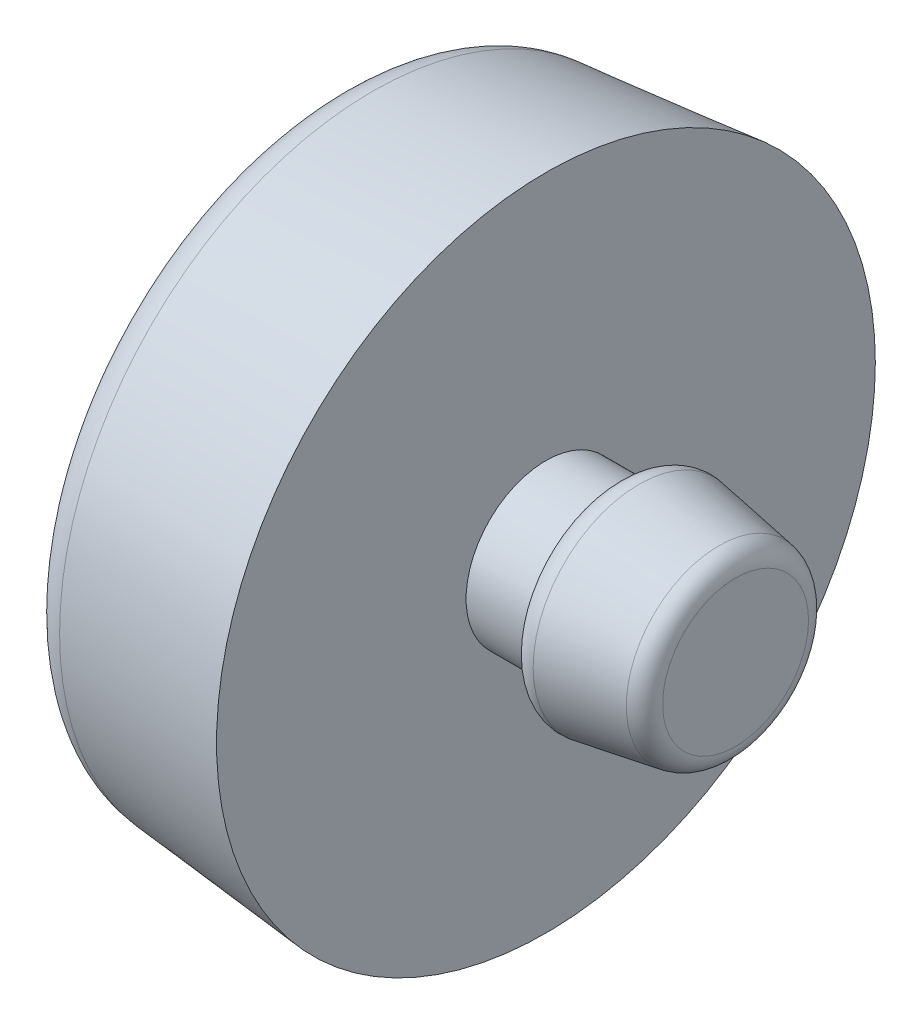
ISO-10303-21;
HEADER;
FILE_DESCRIPTION(('STEP AP214'),'2;1');
FILE_NAME('part.step','',(''),(''),'','','');
FILE_SCHEMA(('AUTOMOTIVE_DESIGN { 1 0 10303 214 1 1 1 1 }'));
ENDSEC;
DATA;
#1=APPLICATION_CONTEXT('core data for automotive mechanical design processes');
#2=APPLICATION_PROTOCOL_DEFINITION('international standard','automotive_design',2000,#1);
#3=PRODUCT_CONTEXT('',#1,'mechanical');
#4=PRODUCT('Part','Part','',(#3));
#5=PRODUCT_RELATED_PRODUCT_CATEGORY('part','',(#4));
#6=PRODUCT_DEFINITION_FORMATION('','',#4);
#7=PRODUCT_DEFINITION_CONTEXT('part definition',#1,'design');
#8=PRODUCT_DEFINITION('design','',#6,#7);
#9=PRODUCT_DEFINITION_SHAPE('','',#8);
#10=(LENGTH_UNIT() NAMED_UNIT(*) SI_UNIT(.MILLI.,.METRE.));
#11=(NAMED_UNIT(*) PLANE_ANGLE_UNIT() SI_UNIT($,.RADIAN.));
#12=(NAMED_UNIT(*) SI_UNIT($,.STERADIAN.) SOLID_ANGLE_UNIT());
#13=UNCERTAINTY_MEASURE_WITH_UNIT(LENGTH_MEASURE(1.E-05),#10,'distance_accuracy_value','');
#14=(GEOMETRIC_REPRESENTATION_CONTEXT(3) GLOBAL_UNCERTAINTY_ASSIGNED_CONTEXT((#13)) GLOBAL_UNIT_ASSIGNED_CONTEXT((#10,
#11,#12)) REPRESENTATION_CONTEXT('',''));
#15=CARTESIAN_POINT('',(0.,0.,0.));
#16=DIRECTION('',(0.,0.,1.));
#17=DIRECTION('',(1.,0.,0.));
#18=AXIS2_PLACEMENT_3D('',#15,#16,#17);
#19=CARTESIAN_POINT('',(-11.,0.,0.));
#20=DIRECTION('',(-1.,0.,0.));
#21=DIRECTION('',(0.,0.,1.));
#22=AXIS2_PLACEMENT_3D('',#19,#20,#21);
#23=PLANE('',#22);
#24=CARTESIAN_POINT('',(-11.,0.,0.));
#25=DIRECTION('',(-1.,0.,0.));
#26=DIRECTION('',(0.,0.,1.));
#27=AXIS2_PLACEMENT_3D('',#24,#25,#26);
#28=CIRCLE('',#27,13.681426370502);
#29=CARTESIAN_POINT('',(-11.,0.,13.681426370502));
#30=VERTEX_POINT('',#29);
#31=EDGE_CURVE('E10',#30,#30,#28,.T.);
#32=ORIENTED_EDGE('',*,*,#31,.T.);
#33=EDGE_LOOP('',(#32));
#34=FACE_BOUND('',#33,.T.);
#35=ADVANCED_FACE('F28',(#34),#23,.T.);
#36=CARTESIAN_POINT('',(-0.5,0.,0.));
#37=DIRECTION('',(1.,0.,0.));
#38=DIRECTION('',(0.,0.,-1.));
#39=AXIS2_PLACEMENT_3D('',#36,#37,#38);
#40=CONICAL_SURFACE('',#39,16.5,0.0949517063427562);
#41=CARTESIAN_POINT('',(-9.18961818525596,0.,0.));
#42=DIRECTION('',(-1.,0.,0.));
#43=DIRECTION('',(0.,0.,1.));
#44=AXIS2_PLACEMENT_3D('',#41,#42,#43);
#45=CIRCLE('',#44,15.6724173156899);
#46=CARTESIAN_POINT('',(-9.18961818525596,0.,15.6724173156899));
#47=VERTEX_POINT('',#46);
#48=EDGE_CURVE('E34',#47,#47,#45,.F.);
#49=ORIENTED_EDGE('',*,*,#48,.T.);
#50=EDGE_LOOP('',(#49));
#51=FACE_BOUND('',#50,.T.);
#52=CARTESIAN_POINT('',(-0.5,0.,0.));
#53=DIRECTION('',(1.,0.,0.));
#54=DIRECTION('',(0.,0.,-1.));
#55=AXIS2_PLACEMENT_3D('',#52,#53,#54);
#56=CIRCLE('',#55,16.5);
#57=CARTESIAN_POINT('',(-0.5,0.,-16.5));
#58=VERTEX_POINT('',#57);
#59=EDGE_CURVE('E53',#58,#58,#56,.T.);
#60=ORIENTED_EDGE('',*,*,#59,.F.);
#61=EDGE_LOOP('',(#60));
#62=FACE_BOUND('',#61,.T.);
#63=ADVANCED_FACE('F77',(#51,#62),#40,.T.);
#64=CARTESIAN_POINT('',(-0.499999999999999,16.5,0.));
#65=DIRECTION('',(1.,0.,0.));
#66=DIRECTION('',(0.,0.,-1.));
#67=AXIS2_PLACEMENT_3D('',#64,#65,#66);
#68=PLANE('',#67);
#69=ORIENTED_EDGE('',*,*,#59,.T.);
#70=EDGE_LOOP('',(#69));
#71=FACE_BOUND('',#70,.T.);
#72=CARTESIAN_POINT('',(-0.499999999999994,0.,0.));
#73=DIRECTION('',(1.,0.,0.));
#74=DIRECTION('',(0.,0.,-1.));
#75=AXIS2_PLACEMENT_3D('',#72,#73,#74);
#76=CIRCLE('',#75,3.99999999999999);
#77=CARTESIAN_POINT('',(-0.499999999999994,0.,-3.99999999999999));
#78=VERTEX_POINT('',#77);
#79=EDGE_CURVE('E56',#78,#78,#76,.T.);
#80=ORIENTED_EDGE('',*,*,#79,.F.);
#81=EDGE_LOOP('',(#80));
#82=FACE_BOUND('',#81,.T.);
#83=ADVANCED_FACE('F67',(#71,#82),#68,.T.);
#84=CARTESIAN_POINT('',(57.,0.,0.));
#85=DIRECTION('',(1.,0.,0.));
#86=DIRECTION('',(0.,0.,-1.));
#87=AXIS2_PLACEMENT_3D('',#84,#85,#86);
#88=CYLINDRICAL_SURFACE('',#87,3.99999999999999);
#89=ORIENTED_EDGE('',*,*,#79,.T.);
#90=EDGE_LOOP('',(#89));
#91=FACE_BOUND('',#90,.T.);
#92=CARTESIAN_POINT('',(3.,0.,0.));
#93=DIRECTION('',(1.,0.,0.));
#94=DIRECTION('',(0.,0.,-1.));
#95=AXIS2_PLACEMENT_3D('',#92,#93,#94);
#96=CIRCLE('',#95,3.99999999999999);
#97=CARTESIAN_POINT('',(3.,0.,-3.99999999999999));
#98=VERTEX_POINT('',#97);
#99=EDGE_CURVE('E59',#98,#98,#96,.T.);
#100=ORIENTED_EDGE('',*,*,#99,.F.);
#101=EDGE_LOOP('',(#100));
#102=FACE_BOUND('',#101,.T.);
#103=ADVANCED_FACE('F65',(#91,#102),#88,.T.);
#104=CARTESIAN_POINT('',(3.,3.99999999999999,0.));
#105=DIRECTION('',(-1.,0.,0.));
#106=DIRECTION('',(0.,0.,1.));
#107=AXIS2_PLACEMENT_3D('',#104,#105,#106);
#108=PLANE('',#107);
#109=CARTESIAN_POINT('',(3.,0.,0.));
#110=DIRECTION('',(-1.,0.,0.));
#111=DIRECTION('',(0.,0.,1.));
#112=AXIS2_PLACEMENT_3D('',#109,#110,#111);
#113=CIRCLE('',#112,4.31953957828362);
#114=CARTESIAN_POINT('',(3.,0.,4.31953957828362));
#115=VERTEX_POINT('',#114);
#116=EDGE_CURVE('E38',#115,#115,#113,.T.);
#117=ORIENTED_EDGE('',*,*,#116,.T.);
#118=EDGE_LOOP('',(#117));
#119=FACE_BOUND('',#118,.T.);
#120=ORIENTED_EDGE('',*,*,#99,.T.);
#121=EDGE_LOOP('',(#120));
#122=FACE_BOUND('',#121,.T.);
#123=ADVANCED_FACE('F63',(#119,#122),#108,.T.);
#124=CARTESIAN_POINT('',(9.,0.,0.));
#125=DIRECTION('',(-1.,0.,0.));
#126=DIRECTION('',(0.,0.,1.));
#127=AXIS2_PLACEMENT_3D('',#124,#125,#126);
#128=CONICAL_SURFACE('',#127,4.49999999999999,0.165148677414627);
#129=CARTESIAN_POINT('',(8.16439898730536,0.,0.));
#130=DIRECTION('',(1.,0.,0.));
#131=DIRECTION('',(0.,0.,-1.));
#132=AXIS2_PLACEMENT_3D('',#129,#130,#131);
#133=CIRCLE('',#132,4.6392668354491);
#134=CARTESIAN_POINT('',(8.16439898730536,0.,-4.6392668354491));
#135=VERTEX_POINT('',#134);
#136=EDGE_CURVE('E42',#135,#135,#133,.F.);
#137=ORIENTED_EDGE('',*,*,#136,.T.);
#138=EDGE_LOOP('',(#137));
#139=FACE_BOUND('',#138,.T.);
#140=CARTESIAN_POINT('',(4.16439898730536,0.,0.));
#141=DIRECTION('',(1.,0.,0.));
#142=DIRECTION('',(0.,0.,-1.));
#143=AXIS2_PLACEMENT_3D('',#140,#141,#142);
#144=CIRCLE('',#143,5.30593350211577);
#145=CARTESIAN_POINT('',(4.16439898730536,0.,-5.30593350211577));
#146=VERTEX_POINT('',#145);
#147=EDGE_CURVE('E47',#146,#146,#144,.T.);
#148=ORIENTED_EDGE('',*,*,#147,.T.);
#149=EDGE_LOOP('',(#148));
#150=FACE_BOUND('',#149,.T.);
#151=ADVANCED_FACE('F74',(#139,#150),#128,.T.);
#152=CARTESIAN_POINT('',(9.,4.49999999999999,0.));
#153=DIRECTION('',(1.,0.,0.));
#154=DIRECTION('',(0.,0.,-1.));
#155=AXIS2_PLACEMENT_3D('',#152,#153,#154);
#156=PLANE('',#155);
#157=CARTESIAN_POINT('',(9.,0.,0.));
#158=DIRECTION('',(1.,0.,0.));
#159=DIRECTION('',(0.,0.,-1.));
#160=AXIS2_PLACEMENT_3D('',#157,#158,#159);
#161=CIRCLE('',#160,3.65287291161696);
#162=CARTESIAN_POINT('',(9.,0.,-3.65287291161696));
#163=VERTEX_POINT('',#162);
#164=EDGE_CURVE('E50',#163,#163,#161,.T.);
#165=ORIENTED_EDGE('',*,*,#164,.T.);
#166=EDGE_LOOP('',(#165));
#167=FACE_BOUND('',#166,.T.);
#168=ADVANCED_FACE('F113',(#167),#156,.T.);
#169=CARTESIAN_POINT('',(8.,0.,0.));
#170=DIRECTION('',(1.,0.,0.));
#171=DIRECTION('',(0.,0.,-1.));
#172=AXIS2_PLACEMENT_3D('',#169,#170,#171);
#173=TOROIDAL_SURFACE('',#172,3.65287291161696,1.);
#174=ORIENTED_EDGE('',*,*,#136,.F.);
#175=EDGE_LOOP('',(#174));
#176=FACE_BOUND('',#175,.T.);
#177=ORIENTED_EDGE('',*,*,#164,.F.);
#178=EDGE_LOOP('',(#177));
#179=FACE_BOUND('',#178,.T.);
#180=ADVANCED_FACE('F123',(#176,#179),#173,.T.);
#181=CARTESIAN_POINT('',(4.,0.,0.));
#182=DIRECTION('',(-1.,0.,0.));
#183=DIRECTION('',(0.,0.,1.));
#184=AXIS2_PLACEMENT_3D('',#181,#182,#183);
#185=TOROIDAL_SURFACE('',#184,4.31953957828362,1.);
#186=ORIENTED_EDGE('',*,*,#116,.F.);
#187=EDGE_LOOP('',(#186));
#188=FACE_BOUND('',#187,.T.);
#189=ORIENTED_EDGE('',*,*,#147,.F.);
#190=EDGE_LOOP('',(#189));
#191=FACE_BOUND('',#190,.T.);
#192=ADVANCED_FACE('F133',(#188,#191),#185,.T.);
#193=CARTESIAN_POINT('',(-9.,0.,0.));
#194=DIRECTION('',(-1.,0.,0.));
#195=DIRECTION('',(0.,0.,1.));
#196=AXIS2_PLACEMENT_3D('',#193,#194,#195);
#197=TOROIDAL_SURFACE('',#196,13.681426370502,2.);
#198=ORIENTED_EDGE('',*,*,#31,.F.);
#199=EDGE_LOOP('',(#198));
#200=FACE_BOUND('',#199,.T.);
#201=ORIENTED_EDGE('',*,*,#48,.F.);
#202=EDGE_LOOP('',(#201));
#203=FACE_BOUND('',#202,.T.);
#204=ADVANCED_FACE('F143',(#200,#203),#197,.T.);
#205=CLOSED_SHELL('',(#35,#63,#83,#103,#123,#151,#168,#180,#192,#204));
#206=MANIFOLD_SOLID_BREP('B2',#205);
#207=ADVANCED_BREP_SHAPE_REPRESENTATION('',(#18,#206),#14);
#208=SHAPE_DEFINITION_REPRESENTATION(#9,#207);
ENDSEC;
END-ISO-10303-21;
